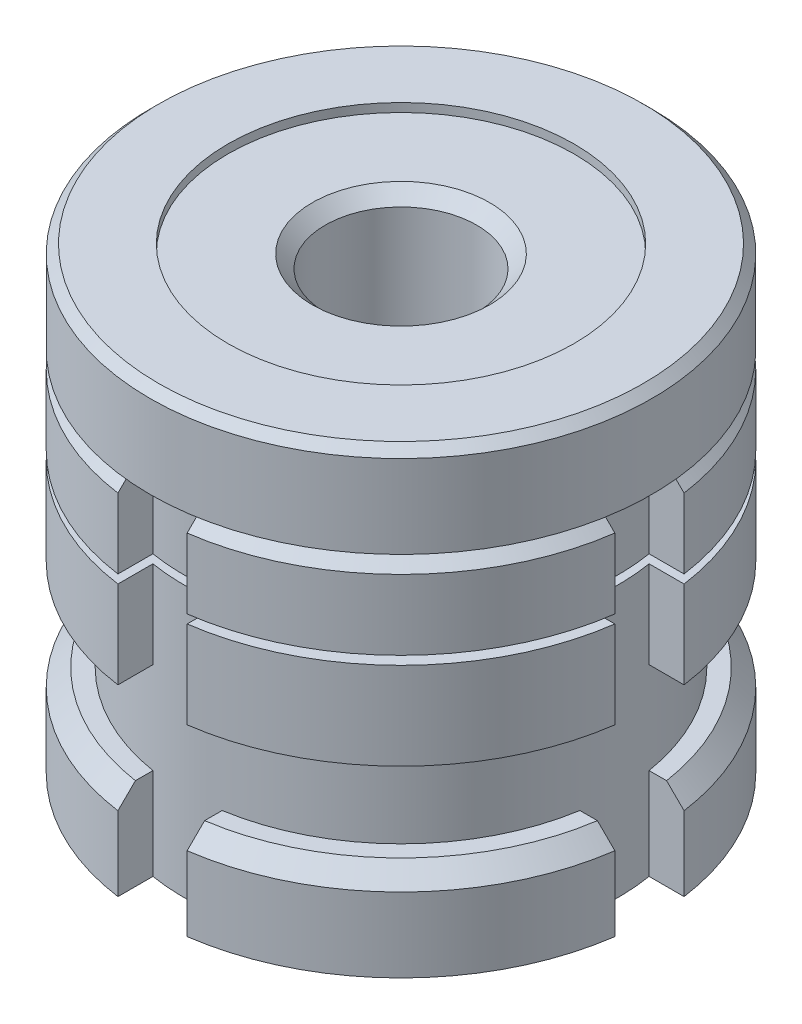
from build123d import *
from build123d.topology import SkipClean

# Parameters (mm, degrees)
SKETCH1_R           = 29
BOSS_EXTRUDE1_DEPTH = 21.2
SKETCH2_W           = 9
SKETCH2_H           = 1
SKETCH3_R           = 25
BOSS_EXTRUDE2_DEPTH = 21.2
SKETCH4_R           = 29
BOSS_EXTRUDE3_DEPTH = 10.6
CUT_EXTRUDE4_START  = -42.4
CUT_EXTRUDE4_DEPTH  = 42.4
CHAMFER1_SIZE       = 2
SKETCH6_R           = 29
BOSS_EXTRUDE4_DEPTH = 10.6
CHAMFER2_SIZE       = 1
CUT_EXTRUDE5_START  = -1
SKETCH7_R           = 20
CUT_EXTRUDE5_DEPTH  = 1
SKETCH8_R           = 8.75
CUT_EXTRUDE6_DEPTH  = 52
CHAMFER3_SIZE       = 1.5


with BuildPart() as part:
    # Sketch1 → Boss-Extrude1 (new body)
    with BuildSketch(Plane(origin=(0, 0, 0), x_dir=(1, 0, 0), z_dir=(0, 1, 0))):
        with Locations(Location((0, 0, 0), (0, 0, 270))):
            Circle(SKETCH1_R)
    extrude(amount=BOSS_EXTRUDE1_DEPTH)

    # Sketch2 → Cut-Revolve1 (revolve, cut)
    with BuildSketch(Plane(origin=(0, 0, 0), x_dir=(0, 0, -1), z_dir=(1, 0, 0))):
        with Locations((-24.5, 10.6)):
            Rectangle(SKETCH2_W, SKETCH2_H)
    revolve(axis=Axis((0, 13.26477, 0), (0, -1, 0)), mode=Mode.SUBTRACT)

    # Sketch3 → Boss-Extrude2 (add)
    with BuildSketch(Plane.XZ):
        with Locations(Location((0, 0, 0), (0, 0, 270))):
            Circle(SKETCH3_R)
    extrude(amount=BOSS_EXTRUDE2_DEPTH)

    # Sketch4 → Boss-Extrude3 (add)
    with BuildSketch(Plane.XZ.offset(21.2)):
        with Locations(Location((0, 0, 0), (0, 0, 90))):
            Circle(SKETCH4_R)
    extrude(amount=-BOSS_EXTRUDE3_DEPTH)

    # Sketch5 → Cut-Extrude4 (cut)
    with SkipClean():  # the faces are left unmerged after this step: merging them gives an invalid solid
        with BuildSketch(Plane(origin=(0, 21.2, 0), x_dir=(1, 0, 0), z_dir=(0, 1, 0)).offset(CUT_EXTRUDE4_START)):
            with BuildLine():
                Line((-28.722813, 4), (-24.677925, 4))
                ThreePointArc((-24.677925, 4), (-25, 0), (-24.677925, -4))
                Line((-24.677925, -4), (-28.722813, -4))
                ThreePointArc((-28.722813, -4), (-29, 0), (-28.722813, 4))
            make_face()
            with BuildLine():
                Line((-4, 28.722813), (-4, 24.677925))
                ThreePointArc((-4, 24.677925), (0, 25), (4, 24.677925))
                Line((4, 24.677925), (4, 28.722813))
                ThreePointArc((4, 28.722813), (0, 29), (-4, 28.722813))
            make_face()
            with BuildLine():
                Line((24.677925, 4), (28.722813, 4))
                ThreePointArc((28.722813, 4), (29, 0), (28.722813, -4))
                Line((28.722813, -4), (24.677925, -4))
                ThreePointArc((24.677925, -4), (25, 0), (24.677925, 4))
            make_face()
            with BuildLine():
                Line((-4, -24.677925), (-4, -28.722813))
                ThreePointArc((-4, -28.722813), (0, -29), (4, -28.722813))
                Line((4, -28.722813), (4, -24.677925))
                ThreePointArc((4, -24.677925), (0, -25), (-4, -24.677925))
            make_face()
        extrude(amount=CUT_EXTRUDE4_DEPTH, mode=Mode.SUBTRACT)

    # Chamfer1
    chamfer1_edges = [part.edges().sort_by_distance(p)[0] for p in [
        (20.506097, -10.6, -20.506097),
        (20.506097, -10.6, 20.506097),
        (-20.506097, -10.6, 20.506097),
        (-20.506097, -10.6, -20.506097),
        (20.506097, 21.2, 20.506097),
        (20.506097, 21.2, -20.506097),
        (-20.506097, 21.2, -20.506097),
        (-20.506097, 21.2, 20.506097),
    ]]
    chamfer(chamfer1_edges, length=CHAMFER1_SIZE)

    # Sketch6 → Boss-Extrude4 (add)
    with BuildSketch(Plane(origin=(0, 21.2, 0), x_dir=(1, 0, 0), z_dir=(0, 1, 0))):
        with Locations(Location((0, 0, 0), (0, 0, 270))):
            Circle(SKETCH6_R)
    extrude(amount=BOSS_EXTRUDE4_DEPTH)

    # Chamfer2
    chamfer2_edges = [part.edges().sort_by_distance(p)[0] for p in [
        (0, 31.8, -29),
    ]]
    chamfer(chamfer2_edges, length=CHAMFER2_SIZE)

    # Sketch7 → Cut-Extrude5 (cut)
    with BuildSketch(Plane(origin=(0, 31.8, 0), x_dir=(1, 0, 0), z_dir=(0, 1, 0)).offset(CUT_EXTRUDE5_START)):
        with Locations(Location((0, 0, 0), (0, 0, 270))):
            Circle(SKETCH7_R)
    extrude(amount=CUT_EXTRUDE5_DEPTH, mode=Mode.SUBTRACT)

    # Sketch8 → Cut-Extrude6 (cut)
    with BuildSketch(Plane(origin=(0, 30.8, 0), x_dir=(1, 0, 0), z_dir=(0, 1, 0))):
        with Locations(Location((0, 0, 0), (0, 0, 270))):
            Circle(SKETCH8_R)
    extrude(amount=-CUT_EXTRUDE6_DEPTH, mode=Mode.SUBTRACT)

    # Chamfer3
    chamfer3_edges = [part.edges().sort_by_distance(p)[0] for p in [
        (0, 30.8, -8.75),
        (0, -21.2, -8.75),
    ]]
    chamfer(chamfer3_edges, length=CHAMFER3_SIZE)


solid = part.part
